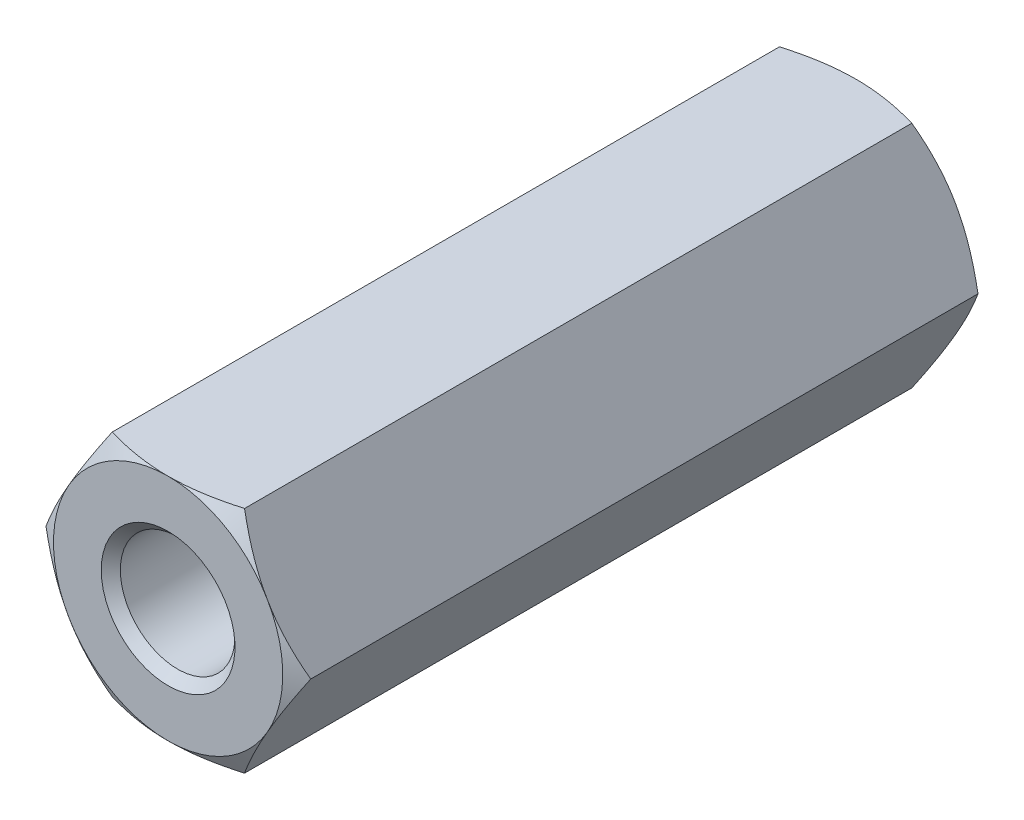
from build123d import *

# Parameters (mm, degrees)
BOSS_EXTRUDE1_DEPTH      = 9
SKETCH2_OUTSIDE_W        = 49.946
SKETCH2_OUTSIDE_H        = 49.018
SKETCH2_OUTSIDE_R        = 3
CUT_EXTRUDE1_DEPTH       = 11.099504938
CUT_EXTRUDE1_DRAFT       = -60
SKETCH3_R                = 1.5
SKETCH3_R_2              = 1.25
CUT_EXTRUDE2_DEPTH       = 9
SKETCH3_2_R              = 1.25
CUT_EXTRUDE3_DEPTH       = 9.75
CHAMFER1_SIZE            = 0.25
MIRROR1_COPY_1_SKETCH_W  = 49.946
MIRROR1_COPY_1_SKETCH_H  = 49.018
MIRROR1_COPY_1_SKETCH_R  = 3
MIRROR1_COPY_1_DEPTH     = 11.099504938
MIRROR1_COPY_1_DRAFT     = -60
CHAMFER1_OF_MIRROR1_SIZE = 0.25


with BuildPart() as part:
    # Sketch1 → Boss-Extrude1 (new body)
    with BuildSketch(Plane.XY):
        Polygon((1.732050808, 3), (-1.732050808, 3), (-3.464101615, 0), (-1.732050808, -3), (1.732050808, -3), (3.464101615, 0), align=None)
    boss_extrude1 = extrude(amount=-BOSS_EXTRUDE1_DEPTH)


with BuildPart() as cut_extrude1_tool:
    # Sketch2 outside → Cut-Extrude1 (with draft: the straight prism first)
    with BuildSketch(Plane(origin=(0, 0, -9), x_dir=(-1, 0, 0), z_dir=(0, 0, -1))):
        Rectangle(SKETCH2_OUTSIDE_W, SKETCH2_OUTSIDE_H)
        Circle(SKETCH2_OUTSIDE_R, mode=Mode.SUBTRACT)
    extrude(amount=-CUT_EXTRUDE1_DEPTH)
    # Cut-Extrude1: the draft: its side faces are tilted about the plane it starts from
    cut_extrude1_sides = [cut_extrude1_tool.faces().sort_by_distance(p)[0] for p in [
        (0, -24.509, -3.450247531),
        (-24.973, 0, -3.450247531),
        (0, 24.509, -3.450247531),
        (24.973, 0, -3.450247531),
        (3, 0, -3.450247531),
    ]]
    draft(cut_extrude1_sides, Plane(origin=(0, 0, -9), x_dir=(-1, 0, 0), z_dir=(0, 0, -1)), CUT_EXTRUDE1_DRAFT)


with BuildPart() as part_1:
    add(part.part)

    # Cut-Extrude1: cut by cut_extrude1_tool
    add(cut_extrude1_tool.part, mode=Mode.SUBTRACT)

    # Sketch3 → Cut-Extrude2 (cut)
    with BuildSketch(Plane(origin=(0, 0, -9), x_dir=(-1, 0, 0), z_dir=(0, 0, -1))):
        Circle(SKETCH3_R)
        Circle(SKETCH3_R_2, mode=Mode.SUBTRACT)
    cut_extrude2 = extrude(amount=-CUT_EXTRUDE2_DEPTH, mode=Mode.SUBTRACT)


with BuildPart() as cut_extrude2_piece_1:
    # of the separate pieces the step leaves, piece 1, a body of its own (cut_extrude2_pieces)
    add(part_1.part.solids().sort_by_distance((1.732050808, 3, 0))[0])

    # Chamfer1
    chamfer1_edges = [cut_extrude2_piece_1.edges().sort_by_distance(p)[0] for p in [
        (1.5, 0, -9),
    ]]
    chamfer(chamfer1_edges, length=CHAMFER1_SIZE)


with BuildPart() as cut_extrude2_piece_2:
    # of the separate pieces the step leaves, piece 2, a body of its own (cut_extrude2_pieces)
    add(part_1.part.solids().sort_by_distance((-1.25, 0, 0))[0])

    # Sketch3_2 → Cut-Extrude3 (cut)
    with BuildSketch(Plane(origin=(0, 0, -9), x_dir=(-1, 0, 0), z_dir=(0, 0, -1))):
        Circle(SKETCH3_2_R)
    cut_extrude3 = extrude(amount=-CUT_EXTRUDE3_DEPTH, mode=Mode.SUBTRACT)


with BuildPart() as cut_extrude2_piece_1_1:
    add(cut_extrude2_piece_1.part)

    # Mirror1: Boss-Extrude1, Cut-Extrude2, Cut-Extrude3 across plane
    add(boss_extrude1.mirror(Plane.XY))
    add(cut_extrude2.mirror(Plane.XY), mode=Mode.SUBTRACT)
    add(cut_extrude3.mirror(Plane.XY), mode=Mode.SUBTRACT)


with BuildPart() as mirror1_copy_1_tool:
    # Mirror1 copy 1 sketch → Mirror1 copy 1 (with draft: the straight prism first)
    with BuildSketch(Plane(origin=(0, 0, 9), x_dir=(-1, 0, 0), z_dir=(0, 0, 1))):
        Rectangle(MIRROR1_COPY_1_SKETCH_W, MIRROR1_COPY_1_SKETCH_H)
        Circle(MIRROR1_COPY_1_SKETCH_R, mode=Mode.SUBTRACT)
    extrude(amount=-MIRROR1_COPY_1_DEPTH)
    # Mirror1 copy 1: the draft: its side faces are tilted about the plane it starts from
    mirror1_copy_1_sides = [mirror1_copy_1_tool.faces().sort_by_distance(p)[0] for p in [
        (0, -24.509, 3.450247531),
        (-24.973, 0, 3.450247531),
        (0, 24.509, 3.450247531),
        (24.973, 0, 3.450247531),
        (3, 0, 3.450247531),
    ]]
    draft(mirror1_copy_1_sides, Plane(origin=(0, 0, 9), x_dir=(-1, 0, 0), z_dir=(0, 0, 1)), MIRROR1_COPY_1_DRAFT)


with BuildPart() as cut_extrude2_piece_1_2:
    add(cut_extrude2_piece_1_1.part)

    # Mirror1 copy 1: cut by mirror1_copy_1_tool
    add(mirror1_copy_1_tool.part, mode=Mode.SUBTRACT)

    # Chamfer1 of Mirror1
    chamfer1_of_mirror1_edges = [cut_extrude2_piece_1_2.edges().sort_by_distance(p)[0] for p in [
        (1.5, 0, 9),
    ]]
    chamfer(chamfer1_of_mirror1_edges, length=CHAMFER1_OF_MIRROR1_SIZE)


solid = cut_extrude2_piece_1_2.part
